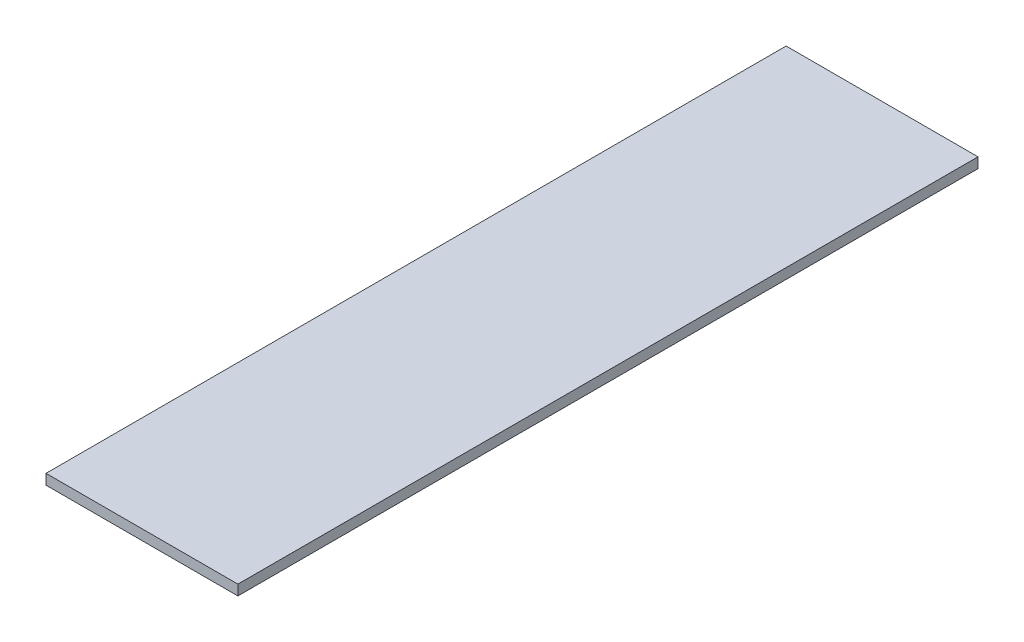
ISO-10303-21;
HEADER;
FILE_DESCRIPTION(('STEP AP214'),'2;1');
FILE_NAME('part.step','',(''),(''),'','','');
FILE_SCHEMA(('AUTOMOTIVE_DESIGN { 1 0 10303 214 1 1 1 1 }'));
ENDSEC;
DATA;
#1=APPLICATION_CONTEXT('core data for automotive mechanical design processes');
#2=APPLICATION_PROTOCOL_DEFINITION('international standard','automotive_design',2000,#1);
#3=PRODUCT_CONTEXT('',#1,'mechanical');
#4=PRODUCT('Part','Part','',(#3));
#5=PRODUCT_RELATED_PRODUCT_CATEGORY('part','',(#4));
#6=PRODUCT_DEFINITION_FORMATION('','',#4);
#7=PRODUCT_DEFINITION_CONTEXT('part definition',#1,'design');
#8=PRODUCT_DEFINITION('design','',#6,#7);
#9=PRODUCT_DEFINITION_SHAPE('','',#8);
#10=(LENGTH_UNIT() NAMED_UNIT(*) SI_UNIT(.MILLI.,.METRE.));
#11=(NAMED_UNIT(*) PLANE_ANGLE_UNIT() SI_UNIT($,.RADIAN.));
#12=(NAMED_UNIT(*) SI_UNIT($,.STERADIAN.) SOLID_ANGLE_UNIT());
#13=UNCERTAINTY_MEASURE_WITH_UNIT(LENGTH_MEASURE(1.E-05),#10,'distance_accuracy_value','');
#14=(GEOMETRIC_REPRESENTATION_CONTEXT(3) GLOBAL_UNCERTAINTY_ASSIGNED_CONTEXT((#13)) GLOBAL_UNIT_ASSIGNED_CONTEXT((#10,
#11,#12)) REPRESENTATION_CONTEXT('',''));
#15=CARTESIAN_POINT('',(0.,0.,0.));
#16=DIRECTION('',(0.,0.,1.));
#17=DIRECTION('',(1.,0.,0.));
#18=AXIS2_PLACEMENT_3D('',#15,#16,#17);
#19=CARTESIAN_POINT('',(44.4500000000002,4.7625,-171.45));
#20=DIRECTION('',(-1.,0.,0.));
#21=DIRECTION('',(0.,0.,1.));
#22=AXIS2_PLACEMENT_3D('',#19,#20,#21);
#23=PLANE('',#22);
#24=DIRECTION('',(0.,0.,-1.));
#25=VECTOR('',#24,1.);
#26=CARTESIAN_POINT('',(44.4500000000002,0.,-171.45));
#27=LINE('',#26,#25);
#28=CARTESIAN_POINT('',(44.4500000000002,0.,171.45));
#29=VERTEX_POINT('',#28);
#30=CARTESIAN_POINT('',(44.4500000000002,0.,-171.45));
#31=VERTEX_POINT('',#30);
#32=EDGE_CURVE('E96',#29,#31,#27,.T.);
#33=ORIENTED_EDGE('',*,*,#32,.T.);
#34=DIRECTION('',(0.,-1.,0.));
#35=VECTOR('',#34,1.);
#36=CARTESIAN_POINT('',(44.4500000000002,4.7625,-171.45));
#37=LINE('',#36,#35);
#38=CARTESIAN_POINT('',(44.4500000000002,4.7625,-171.45));
#39=VERTEX_POINT('',#38);
#40=EDGE_CURVE('E11',#39,#31,#37,.T.);
#41=ORIENTED_EDGE('',*,*,#40,.F.);
#42=DIRECTION('',(0.,0.,-1.));
#43=VECTOR('',#42,1.);
#44=CARTESIAN_POINT('',(44.4500000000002,4.7625,-171.45));
#45=LINE('',#44,#43);
#46=CARTESIAN_POINT('',(44.4500000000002,4.7625,171.45));
#47=VERTEX_POINT('',#46);
#48=EDGE_CURVE('E84',#47,#39,#45,.T.);
#49=ORIENTED_EDGE('',*,*,#48,.F.);
#50=DIRECTION('',(0.,-1.,0.));
#51=VECTOR('',#50,1.);
#52=CARTESIAN_POINT('',(44.4500000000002,4.7625,171.45));
#53=LINE('',#52,#51);
#54=EDGE_CURVE('E92',#47,#29,#53,.T.);
#55=ORIENTED_EDGE('',*,*,#54,.T.);
#56=EDGE_LOOP('',(#33,#41,#49,#55));
#57=FACE_BOUND('',#56,.T.);
#58=ADVANCED_FACE('F33',(#57),#23,.F.);
#59=CARTESIAN_POINT('',(-44.4499999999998,4.7625,-171.45));
#60=DIRECTION('',(0.,0.,1.));
#61=DIRECTION('',(1.,0.,0.));
#62=AXIS2_PLACEMENT_3D('',#59,#60,#61);
#63=PLANE('',#62);
#64=DIRECTION('',(-1.,0.,0.));
#65=VECTOR('',#64,1.);
#66=CARTESIAN_POINT('',(-44.4499999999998,0.,-171.45));
#67=LINE('',#66,#65);
#68=CARTESIAN_POINT('',(-44.4499999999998,0.,-171.45));
#69=VERTEX_POINT('',#68);
#70=EDGE_CURVE('E88',#31,#69,#67,.T.);
#71=ORIENTED_EDGE('',*,*,#70,.T.);
#72=DIRECTION('',(0.,-1.,0.));
#73=VECTOR('',#72,1.);
#74=CARTESIAN_POINT('',(-44.4499999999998,4.7625,-171.45));
#75=LINE('',#74,#73);
#76=CARTESIAN_POINT('',(-44.4499999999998,4.7625,-171.45));
#77=VERTEX_POINT('',#76);
#78=EDGE_CURVE('E41',#77,#69,#75,.T.);
#79=ORIENTED_EDGE('',*,*,#78,.F.);
#80=DIRECTION('',(-1.,0.,0.));
#81=VECTOR('',#80,1.);
#82=CARTESIAN_POINT('',(-44.4499999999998,4.7625,-171.45));
#83=LINE('',#82,#81);
#84=EDGE_CURVE('E79',#39,#77,#83,.T.);
#85=ORIENTED_EDGE('',*,*,#84,.F.);
#86=ORIENTED_EDGE('',*,*,#40,.T.);
#87=EDGE_LOOP('',(#71,#79,#85,#86));
#88=FACE_BOUND('',#87,.T.);
#89=ADVANCED_FACE('F87',(#88),#63,.F.);
#90=CARTESIAN_POINT('',(-44.4499999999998,4.7625,-171.45));
#91=DIRECTION('',(1.,0.,0.));
#92=DIRECTION('',(0.,0.,-1.));
#93=AXIS2_PLACEMENT_3D('',#90,#91,#92);
#94=PLANE('',#93);
#95=DIRECTION('',(0.,0.,1.));
#96=VECTOR('',#95,1.);
#97=CARTESIAN_POINT('',(-44.4499999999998,0.,-171.45));
#98=LINE('',#97,#96);
#99=CARTESIAN_POINT('',(-44.4499999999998,0.,171.45));
#100=VERTEX_POINT('',#99);
#101=EDGE_CURVE('E66',#69,#100,#98,.T.);
#102=ORIENTED_EDGE('',*,*,#101,.T.);
#103=DIRECTION('',(0.,-1.,0.));
#104=VECTOR('',#103,1.);
#105=CARTESIAN_POINT('',(-44.4499999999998,4.7625,171.45));
#106=LINE('',#105,#104);
#107=CARTESIAN_POINT('',(-44.4499999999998,4.7625,171.45));
#108=VERTEX_POINT('',#107);
#109=EDGE_CURVE('E89',#108,#100,#106,.T.);
#110=ORIENTED_EDGE('',*,*,#109,.F.);
#111=DIRECTION('',(0.,0.,1.));
#112=VECTOR('',#111,1.);
#113=CARTESIAN_POINT('',(-44.4499999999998,4.7625,-171.45));
#114=LINE('',#113,#112);
#115=EDGE_CURVE('E82',#77,#108,#114,.T.);
#116=ORIENTED_EDGE('',*,*,#115,.F.);
#117=ORIENTED_EDGE('',*,*,#78,.T.);
#118=EDGE_LOOP('',(#102,#110,#116,#117));
#119=FACE_BOUND('',#118,.T.);
#120=ADVANCED_FACE('F90',(#119),#94,.F.);
#121=CARTESIAN_POINT('',(-44.4499999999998,4.7625,171.45));
#122=DIRECTION('',(0.,0.,-1.));
#123=DIRECTION('',(-1.,0.,0.));
#124=AXIS2_PLACEMENT_3D('',#121,#122,#123);
#125=PLANE('',#124);
#126=DIRECTION('',(1.,0.,0.));
#127=VECTOR('',#126,1.);
#128=CARTESIAN_POINT('',(-44.4499999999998,0.,171.45));
#129=LINE('',#128,#127);
#130=EDGE_CURVE('E72',#100,#29,#129,.T.);
#131=ORIENTED_EDGE('',*,*,#130,.T.);
#132=ORIENTED_EDGE('',*,*,#54,.F.);
#133=DIRECTION('',(1.,0.,0.));
#134=VECTOR('',#133,1.);
#135=CARTESIAN_POINT('',(-44.4499999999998,4.7625,171.45));
#136=LINE('',#135,#134);
#137=EDGE_CURVE('E49',#108,#47,#136,.T.);
#138=ORIENTED_EDGE('',*,*,#137,.F.);
#139=ORIENTED_EDGE('',*,*,#109,.T.);
#140=EDGE_LOOP('',(#131,#132,#138,#139));
#141=FACE_BOUND('',#140,.T.);
#142=ADVANCED_FACE('F103',(#141),#125,.F.);
#143=CARTESIAN_POINT('',(0.,4.7625,0.));
#144=DIRECTION('',(0.,1.,0.));
#145=DIRECTION('',(0.,0.,1.));
#146=AXIS2_PLACEMENT_3D('',#143,#144,#145);
#147=PLANE('',#146);
#148=ORIENTED_EDGE('',*,*,#48,.T.);
#149=ORIENTED_EDGE('',*,*,#84,.T.);
#150=ORIENTED_EDGE('',*,*,#115,.T.);
#151=ORIENTED_EDGE('',*,*,#137,.T.);
#152=EDGE_LOOP('',(#148,#149,#150,#151));
#153=FACE_BOUND('',#152,.T.);
#154=ADVANCED_FACE('F80',(#153),#147,.T.);
#155=CARTESIAN_POINT('',(0.,0.,0.));
#156=DIRECTION('',(0.,1.,0.));
#157=DIRECTION('',(0.,0.,1.));
#158=AXIS2_PLACEMENT_3D('',#155,#156,#157);
#159=PLANE('',#158);
#160=ORIENTED_EDGE('',*,*,#32,.F.);
#161=ORIENTED_EDGE('',*,*,#130,.F.);
#162=ORIENTED_EDGE('',*,*,#101,.F.);
#163=ORIENTED_EDGE('',*,*,#70,.F.);
#164=EDGE_LOOP('',(#160,#161,#162,#163));
#165=FACE_BOUND('',#164,.T.);
#166=ADVANCED_FACE('F106',(#165),#159,.F.);
#167=CLOSED_SHELL('',(#58,#89,#120,#142,#154,#166));
#168=MANIFOLD_SOLID_BREP('B2',#167);
#169=ADVANCED_BREP_SHAPE_REPRESENTATION('',(#18,#168),#14);
#170=SHAPE_DEFINITION_REPRESENTATION(#9,#169);
ENDSEC;
END-ISO-10303-21;
